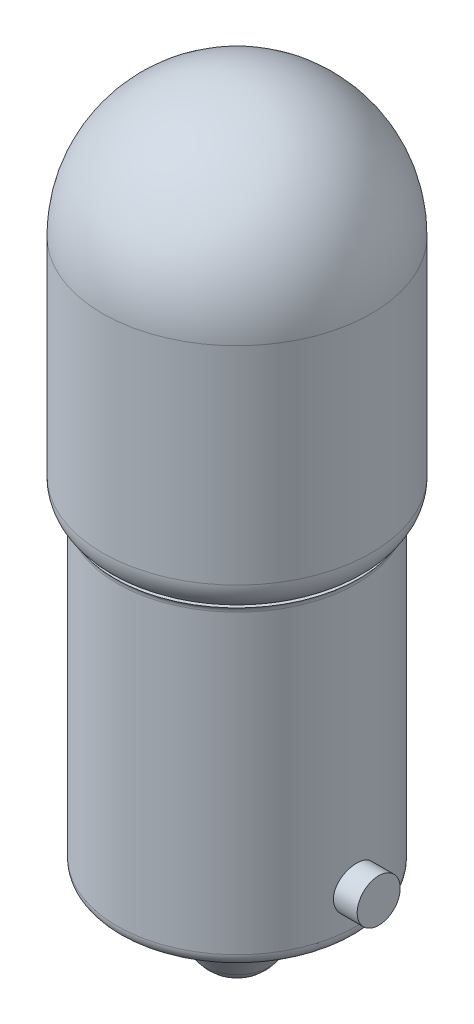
ISO-10303-21;
HEADER;
FILE_DESCRIPTION(('STEP AP214'),'2;1');
FILE_NAME('part.step','',(''),(''),'','','');
FILE_SCHEMA(('AUTOMOTIVE_DESIGN { 1 0 10303 214 1 1 1 1 }'));
ENDSEC;
DATA;
#1=APPLICATION_CONTEXT('core data for automotive mechanical design processes');
#2=APPLICATION_PROTOCOL_DEFINITION('international standard','automotive_design',2000,#1);
#3=PRODUCT_CONTEXT('',#1,'mechanical');
#4=PRODUCT('Part','Part','',(#3));
#5=PRODUCT_RELATED_PRODUCT_CATEGORY('part','',(#4));
#6=PRODUCT_DEFINITION_FORMATION('','',#4);
#7=PRODUCT_DEFINITION_CONTEXT('part definition',#1,'design');
#8=PRODUCT_DEFINITION('design','',#6,#7);
#9=PRODUCT_DEFINITION_SHAPE('','',#8);
#10=(LENGTH_UNIT() NAMED_UNIT(*) SI_UNIT(.MILLI.,.METRE.));
#11=(NAMED_UNIT(*) PLANE_ANGLE_UNIT() SI_UNIT($,.RADIAN.));
#12=(NAMED_UNIT(*) SI_UNIT($,.STERADIAN.) SOLID_ANGLE_UNIT());
#13=UNCERTAINTY_MEASURE_WITH_UNIT(LENGTH_MEASURE(1.E-05),#10,'distance_accuracy_value','');
#14=(GEOMETRIC_REPRESENTATION_CONTEXT(3) GLOBAL_UNCERTAINTY_ASSIGNED_CONTEXT((#13)) GLOBAL_UNIT_ASSIGNED_CONTEXT((#10,
#11,#12)) REPRESENTATION_CONTEXT('',''));
#15=CARTESIAN_POINT('',(0.,0.,0.));
#16=DIRECTION('',(0.,0.,1.));
#17=DIRECTION('',(1.,0.,0.));
#18=AXIS2_PLACEMENT_3D('',#15,#16,#17);
#19=CARTESIAN_POINT('',(0.,12.0875666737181,-4.67973655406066));
#20=DIRECTION('',(0.,-1.,0.));
#21=DIRECTION('',(0.,0.,-1.));
#22=AXIS2_PLACEMENT_3D('',#19,#20,#21);
#23=PLANE('',#22);
#24=CARTESIAN_POINT('',(0.,12.0875666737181,0.));
#25=DIRECTION('',(0.,1.,0.));
#26=DIRECTION('',(0.,0.,1.));
#27=AXIS2_PLACEMENT_3D('',#24,#25,#26);
#28=CIRCLE('',#27,4.67973655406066);
#29=CARTESIAN_POINT('',(0.,12.0875666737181,4.67973655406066));
#30=VERTEX_POINT('',#29);
#31=EDGE_CURVE('E117',#30,#30,#28,.T.);
#32=ORIENTED_EDGE('',*,*,#31,.T.);
#33=EDGE_LOOP('',(#32));
#34=FACE_BOUND('',#33,.T.);
#35=CARTESIAN_POINT('',(0.,12.0875666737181,0.));
#36=DIRECTION('',(0.,-1.,0.));
#37=DIRECTION('',(0.,0.,-1.));
#38=AXIS2_PLACEMENT_3D('',#35,#36,#37);
#39=CIRCLE('',#38,4.52740410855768);
#40=CARTESIAN_POINT('',(0.,12.0875666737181,-4.52740410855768));
#41=VERTEX_POINT('',#40);
#42=EDGE_CURVE('E10',#41,#41,#39,.F.);
#43=ORIENTED_EDGE('',*,*,#42,.F.);
#44=EDGE_LOOP('',(#43));
#45=FACE_BOUND('',#44,.T.);
#46=ADVANCED_FACE('F36',(#34,#45),#23,.F.);
#47=CARTESIAN_POINT('',(0.,0.,0.));
#48=DIRECTION('',(0.,1.,0.));
#49=DIRECTION('',(0.,0.,1.));
#50=AXIS2_PLACEMENT_3D('',#47,#48,#49);
#51=PLANE('',#50);
#52=CARTESIAN_POINT('',(0.,0.,0.));
#53=DIRECTION('',(0.,1.,0.));
#54=DIRECTION('',(0.,0.,1.));
#55=AXIS2_PLACEMENT_3D('',#52,#53,#54);
#56=CIRCLE('',#55,4.0894);
#57=CARTESIAN_POINT('',(0.,0.,4.0894));
#58=VERTEX_POINT('',#57);
#59=EDGE_CURVE('E48',#58,#58,#56,.F.);
#60=ORIENTED_EDGE('',*,*,#59,.T.);
#61=EDGE_LOOP('',(#60));
#62=FACE_BOUND('',#61,.T.);
#63=CARTESIAN_POINT('',(0.,0.,0.));
#64=DIRECTION('',(0.,1.,0.));
#65=DIRECTION('',(0.,0.,1.));
#66=AXIS2_PLACEMENT_3D('',#63,#64,#65);
#67=CIRCLE('',#66,2.9845);
#68=CARTESIAN_POINT('',(0.,0.,2.9845));
#69=VERTEX_POINT('',#68);
#70=EDGE_CURVE('E44',#69,#69,#67,.F.);
#71=ORIENTED_EDGE('',*,*,#70,.F.);
#72=EDGE_LOOP('',(#71));
#73=FACE_BOUND('',#72,.T.);
#74=ADVANCED_FACE('F89',(#62,#73),#51,.F.);
#75=CARTESIAN_POINT('',(0.,11.8872,0.));
#76=DIRECTION('',(0.,-1.,0.));
#77=DIRECTION('',(0.,0.,-1.));
#78=AXIS2_PLACEMENT_3D('',#75,#76,#77);
#79=CYLINDRICAL_SURFACE('',#78,4.5974);
#80=CARTESIAN_POINT('',(-4.52268023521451,1.778,-0.8255));
#81=CARTESIAN_POINT('',(-4.52268110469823,1.82396588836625,-0.825498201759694));
#82=CARTESIAN_POINT('',(-4.52338859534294,1.8699555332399,-0.821647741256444));
#83=CARTESIAN_POINT('',(-4.52613896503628,1.9606405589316,-0.806356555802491));
#84=CARTESIAN_POINT('',(-4.52818301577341,2.0053347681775,-0.794909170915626));
#85=CARTESIAN_POINT('',(-4.53336770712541,2.09210356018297,-0.764784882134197));
#86=CARTESIAN_POINT('',(-4.5365073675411,2.1341804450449,-0.746114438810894));
#87=CARTESIAN_POINT('',(-4.54352835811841,2.21460120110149,-0.702090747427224));
#88=CARTESIAN_POINT('',(-4.54740962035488,2.25294541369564,-0.676738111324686));
#89=CARTESIAN_POINT('',(-4.55552601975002,2.32525388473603,-0.619760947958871));
#90=CARTESIAN_POINT('',(-4.55976437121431,2.35916931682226,-0.58807490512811));
#91=CARTESIAN_POINT('',(-4.56808894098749,2.42123259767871,-0.519463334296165));
#92=CARTESIAN_POINT('',(-4.57217514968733,2.44938008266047,-0.482537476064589));
#93=CARTESIAN_POINT('',(-4.5797693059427,2.49929408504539,-0.404175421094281));
#94=CARTESIAN_POINT('',(-4.58327302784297,2.52101479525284,-0.362709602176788));
#95=CARTESIAN_POINT('',(-4.5892715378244,2.55716383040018,-0.276644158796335));
#96=CARTESIAN_POINT('',(-4.59176640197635,2.57159270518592,-0.232044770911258));
#97=CARTESIAN_POINT('',(-4.59544339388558,2.59259813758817,-0.141483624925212));
#98=CARTESIAN_POINT('',(-4.59663925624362,2.59925690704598,-0.0955415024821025));
#99=CARTESIAN_POINT('',(-4.59763078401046,2.60478906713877,-0.00317762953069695));
#100=CARTESIAN_POINT('',(-4.59742655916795,2.60366306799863,0.0432440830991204));
#101=CARTESIAN_POINT('',(-4.59565171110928,2.5937211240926,0.134686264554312));
#102=CARTESIAN_POINT('',(-4.59409681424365,2.58499368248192,0.179716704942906));
#103=CARTESIAN_POINT('',(-4.58981292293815,2.560236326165,0.267663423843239));
#104=CARTESIAN_POINT('',(-4.58708388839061,2.544206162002,0.310579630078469));
#105=CARTESIAN_POINT('',(-4.58073187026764,2.50521264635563,0.393338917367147));
#106=CARTESIAN_POINT('',(-4.57710428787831,2.48221348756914,0.433164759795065));
#107=CARTESIAN_POINT('',(-4.56935708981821,2.42996116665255,0.508425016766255));
#108=CARTESIAN_POINT('',(-4.5652374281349,2.40070741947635,0.543859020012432));
#109=CARTESIAN_POINT('',(-4.55689470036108,2.33628735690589,0.609853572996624));
#110=CARTESIAN_POINT('',(-4.55267099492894,2.30104363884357,0.640338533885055));
#111=CARTESIAN_POINT('',(-4.54465188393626,2.22590307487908,0.69497546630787));
#112=CARTESIAN_POINT('',(-4.54085648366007,2.18600617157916,0.719127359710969));
#113=CARTESIAN_POINT('',(-4.53412300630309,2.10259651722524,0.760431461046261));
#114=CARTESIAN_POINT('',(-4.53118618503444,2.05907858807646,0.777573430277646));
#115=CARTESIAN_POINT('',(-4.52652217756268,1.96971601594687,0.804281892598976));
#116=CARTESIAN_POINT('',(-4.52479486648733,1.92387161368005,0.813849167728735));
#117=CARTESIAN_POINT('',(-4.52276995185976,1.83183697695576,0.825027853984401));
#118=CARTESIAN_POINT('',(-4.52245289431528,1.78566030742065,0.826747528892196));
#119=CARTESIAN_POINT('',(-4.52323242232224,1.69367939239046,0.82247174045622));
#120=CARTESIAN_POINT('',(-4.52432894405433,1.64787513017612,0.816476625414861));
#121=CARTESIAN_POINT('',(-4.52779401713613,1.55829040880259,0.797034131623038));
#122=CARTESIAN_POINT('',(-4.53015298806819,1.51449736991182,0.783642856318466));
#123=CARTESIAN_POINT('',(-4.5358689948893,1.42977674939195,0.749847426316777));
#124=CARTESIAN_POINT('',(-4.5392260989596,1.38884936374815,0.729442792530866));
#125=CARTESIAN_POINT('',(-4.54660476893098,1.31054294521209,0.681948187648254));
#126=CARTESIAN_POINT('',(-4.55063302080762,1.27320627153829,0.654789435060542));
#127=CARTESIAN_POINT('',(-4.55888100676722,1.20358115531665,0.594650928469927));
#128=CARTESIAN_POINT('',(-4.56310075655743,1.17129312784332,0.561670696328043));
#129=CARTESIAN_POINT('',(-4.57131841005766,1.11228098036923,0.490343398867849));
#130=CARTESIAN_POINT('',(-4.57531298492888,1.08562943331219,0.451935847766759));
#131=CARTESIAN_POINT('',(-4.58257525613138,1.03915744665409,0.371125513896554));
#132=CARTESIAN_POINT('',(-4.58584297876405,1.0193367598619,0.32872287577));
#133=CARTESIAN_POINT('',(-4.59126898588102,0.987199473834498,0.241332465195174));
#134=CARTESIAN_POINT('',(-4.59343266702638,0.974846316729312,0.196358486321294));
#135=CARTESIAN_POINT('',(-4.59642974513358,0.957877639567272,0.104931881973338));
#136=CARTESIAN_POINT('',(-4.59726326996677,0.953261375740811,0.0584793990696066));
#137=CARTESIAN_POINT('',(-4.59750386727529,0.951921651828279,-0.0338878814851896));
#138=CARTESIAN_POINT('',(-4.59693080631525,0.955088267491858,-0.0798010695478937));
#139=CARTESIAN_POINT('',(-4.59446361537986,0.96898484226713,-0.170430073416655));
#140=CARTESIAN_POINT('',(-4.59256949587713,0.979714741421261,-0.215145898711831));
#141=CARTESIAN_POINT('',(-4.5876726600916,1.00838857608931,-0.302059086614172));
#142=CARTESIAN_POINT('',(-4.58467160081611,1.02632173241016,-0.344260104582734));
#143=CARTESIAN_POINT('',(-4.57788682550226,1.0688802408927,-0.425070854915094));
#144=CARTESIAN_POINT('',(-4.57410306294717,1.09350599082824,-0.463680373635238));
#145=CARTESIAN_POINT('',(-4.56610818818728,1.14913352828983,-0.536762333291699));
#146=CARTESIAN_POINT('',(-4.5618920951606,1.18021517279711,-0.571173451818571));
#147=CARTESIAN_POINT('',(-4.55354035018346,1.24770565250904,-0.634329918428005));
#148=CARTESIAN_POINT('',(-4.54940471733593,1.28411573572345,-0.663073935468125));
#149=CARTESIAN_POINT('',(-4.54164448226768,1.36159332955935,-0.714304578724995));
#150=CARTESIAN_POINT('',(-4.53802444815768,1.40269727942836,-0.736736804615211));
#151=CARTESIAN_POINT('',(-4.53175981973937,1.48814061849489,-0.774342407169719));
#152=CARTESIAN_POINT('',(-4.52911428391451,1.53247683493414,-0.789522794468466));
#153=CARTESIAN_POINT('',(-4.52566377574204,1.6104675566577,-0.80902449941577));
#154=CARTESIAN_POINT('',(-4.52455142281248,1.64365896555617,-0.815192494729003));
#155=CARTESIAN_POINT('',(-4.52305934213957,1.71056266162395,-0.823430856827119));
#156=CARTESIAN_POINT('',(-4.52267959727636,1.74427493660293,-0.825501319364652));
#157=CARTESIAN_POINT('',(-4.52268023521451,1.778,-0.8255));
#158=B_SPLINE_CURVE_WITH_KNOTS('',3,(#80,#81,#82,#83,#84,#85,#86,#87,#88,#89,#90,#91,#92,#93,
#94,#95,#96,#97,#98,#99,#100,#101,#102,#103,#104,#105,#106,#107,#108,#109,#110,#111,#112,#113,
#114,#115,#116,#117,#118,#119,#120,#121,#122,#123,#124,#125,#126,#127,#128,#129,#130,#131,#132,
#133,#134,#135,#136,#137,#138,#139,#140,#141,#142,#143,#144,#145,#146,#147,#148,#149,#150,#151,
#152,#153,#154,#155,#156,#157),.UNSPECIFIED.,.T.,.F.,(4,2,2,2,2,2,2,2,2,2,2,2,2,2,2,2,2,2,2,2,2,
2,2,2,2,2,2,2,2,2,2,2,2,2,2,2,2,2,4),(0.,0.137774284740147,0.275669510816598,0.413441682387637,
0.551201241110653,0.690370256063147,0.829548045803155,0.969695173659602,1.10983173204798,
1.24847172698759,1.38710085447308,1.52413718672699,1.66117820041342,1.79893563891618,
1.93670596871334,2.07641483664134,2.21612542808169,2.35603935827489,2.49593884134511,
2.63390234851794,2.77185962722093,2.9087845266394,3.04571878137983,3.18410912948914,
3.3225108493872,3.46259861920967,3.60268131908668,3.74207255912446,3.88145039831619,
4.0188710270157,4.15629056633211,4.29350522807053,4.43072804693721,4.56976182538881,
4.70882822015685,4.84905885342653,4.98915364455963,5.09024067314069,5.19132533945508),.UNSPECIFIED.);
#159=CARTESIAN_POINT('',(-4.52268023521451,1.778,-0.8255));
#160=VERTEX_POINT('',#159);
#161=EDGE_CURVE('E62',#160,#160,#158,.T.);
#162=ORIENTED_EDGE('',*,*,#161,.T.);
#163=EDGE_LOOP('',(#162));
#164=FACE_BOUND('',#163,.T.);
#165=CARTESIAN_POINT('',(4.52268023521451,1.778,-0.8255));
#166=CARTESIAN_POINT('',(4.52268110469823,1.73203411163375,-0.825498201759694));
#167=CARTESIAN_POINT('',(4.52338859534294,1.6860444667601,-0.821647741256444));
#168=CARTESIAN_POINT('',(4.52613896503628,1.5953594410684,-0.806356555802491));
#169=CARTESIAN_POINT('',(4.52818301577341,1.5506652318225,-0.794909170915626));
#170=CARTESIAN_POINT('',(4.53336770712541,1.46389643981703,-0.764784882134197));
#171=CARTESIAN_POINT('',(4.5365073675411,1.4218195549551,-0.746114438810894));
#172=CARTESIAN_POINT('',(4.54352835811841,1.34139879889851,-0.702090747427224));
#173=CARTESIAN_POINT('',(4.54740962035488,1.30305458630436,-0.676738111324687));
#174=CARTESIAN_POINT('',(4.55552601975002,1.23074611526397,-0.619760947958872));
#175=CARTESIAN_POINT('',(4.55976437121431,1.19683068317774,-0.588074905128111));
#176=CARTESIAN_POINT('',(4.56808894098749,1.13476740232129,-0.519463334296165));
#177=CARTESIAN_POINT('',(4.57217514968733,1.10661991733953,-0.482537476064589));
#178=CARTESIAN_POINT('',(4.5797693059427,1.05670591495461,-0.404175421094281));
#179=CARTESIAN_POINT('',(4.58327302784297,1.03498520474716,-0.362709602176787));
#180=CARTESIAN_POINT('',(4.5892715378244,0.998836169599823,-0.276644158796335));
#181=CARTESIAN_POINT('',(4.59176640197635,0.984407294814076,-0.232044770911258));
#182=CARTESIAN_POINT('',(4.59544339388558,0.963401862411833,-0.141483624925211));
#183=CARTESIAN_POINT('',(4.59663925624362,0.956743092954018,-0.0955415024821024));
#184=CARTESIAN_POINT('',(4.59763078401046,0.95121093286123,-0.00317762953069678));
#185=CARTESIAN_POINT('',(4.59742655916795,0.952336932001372,0.0432440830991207));
#186=CARTESIAN_POINT('',(4.59565171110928,0.962278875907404,0.134686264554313));
#187=CARTESIAN_POINT('',(4.59409681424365,0.971006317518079,0.179716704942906));
#188=CARTESIAN_POINT('',(4.58981292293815,0.995763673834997,0.267663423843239));
#189=CARTESIAN_POINT('',(4.58708388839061,1.011793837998,0.310579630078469));
#190=CARTESIAN_POINT('',(4.58073187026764,1.05078735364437,0.393338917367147));
#191=CARTESIAN_POINT('',(4.57710428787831,1.07378651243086,0.433164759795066));
#192=CARTESIAN_POINT('',(4.56935708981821,1.12603883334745,0.508425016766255));
#193=CARTESIAN_POINT('',(4.5652374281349,1.15529258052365,0.543859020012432));
#194=CARTESIAN_POINT('',(4.55689470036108,1.21971264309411,0.609853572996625));
#195=CARTESIAN_POINT('',(4.55267099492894,1.25495636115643,0.640338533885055));
#196=CARTESIAN_POINT('',(4.54465188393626,1.33009692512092,0.694975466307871));
#197=CARTESIAN_POINT('',(4.54085648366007,1.36999382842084,0.719127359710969));
#198=CARTESIAN_POINT('',(4.53412300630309,1.45340348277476,0.760431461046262));
#199=CARTESIAN_POINT('',(4.53118618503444,1.49692141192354,0.777573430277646));
#200=CARTESIAN_POINT('',(4.52652217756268,1.58628398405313,0.804281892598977));
#201=CARTESIAN_POINT('',(4.52479486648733,1.63212838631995,0.813849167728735));
#202=CARTESIAN_POINT('',(4.52276995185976,1.72416302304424,0.825027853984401));
#203=CARTESIAN_POINT('',(4.52245289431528,1.77033969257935,0.826747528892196));
#204=CARTESIAN_POINT('',(4.52323242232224,1.86232060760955,0.82247174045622));
#205=CARTESIAN_POINT('',(4.52432894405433,1.90812486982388,0.816476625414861));
#206=CARTESIAN_POINT('',(4.52779401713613,1.99770959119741,0.797034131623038));
#207=CARTESIAN_POINT('',(4.53015298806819,2.04150263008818,0.783642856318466));
#208=CARTESIAN_POINT('',(4.5358689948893,2.12622325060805,0.749847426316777));
#209=CARTESIAN_POINT('',(4.5392260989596,2.16715063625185,0.729442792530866));
#210=CARTESIAN_POINT('',(4.54660476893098,2.24545705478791,0.681948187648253));
#211=CARTESIAN_POINT('',(4.55063302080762,2.28279372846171,0.654789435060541));
#212=CARTESIAN_POINT('',(4.55888100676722,2.35241884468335,0.594650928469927));
#213=CARTESIAN_POINT('',(4.56310075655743,2.38470687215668,0.561670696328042));
#214=CARTESIAN_POINT('',(4.57131841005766,2.44371901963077,0.490343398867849));
#215=CARTESIAN_POINT('',(4.57531298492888,2.47037056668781,0.451935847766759));
#216=CARTESIAN_POINT('',(4.58257525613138,2.51684255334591,0.371125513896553));
#217=CARTESIAN_POINT('',(4.58584297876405,2.5366632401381,0.328722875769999));
#218=CARTESIAN_POINT('',(4.59126898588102,2.5688005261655,0.241332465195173));
#219=CARTESIAN_POINT('',(4.59343266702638,2.58115368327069,0.196358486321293));
#220=CARTESIAN_POINT('',(4.59642974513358,2.59812236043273,0.104931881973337));
#221=CARTESIAN_POINT('',(4.59726326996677,2.60273862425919,0.0584793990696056));
#222=CARTESIAN_POINT('',(4.59750386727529,2.60407834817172,-0.0338878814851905));
#223=CARTESIAN_POINT('',(4.59693080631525,2.60091173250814,-0.0798010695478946));
#224=CARTESIAN_POINT('',(4.59446361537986,2.58701515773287,-0.170430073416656));
#225=CARTESIAN_POINT('',(4.59256949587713,2.57628525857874,-0.215145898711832));
#226=CARTESIAN_POINT('',(4.5876726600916,2.54761142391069,-0.302059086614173));
#227=CARTESIAN_POINT('',(4.58467160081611,2.52967826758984,-0.344260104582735));
#228=CARTESIAN_POINT('',(4.57788682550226,2.4871197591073,-0.425070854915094));
#229=CARTESIAN_POINT('',(4.57410306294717,2.46249400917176,-0.463680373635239));
#230=CARTESIAN_POINT('',(4.56610818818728,2.40686647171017,-0.5367623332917));
#231=CARTESIAN_POINT('',(4.5618920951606,2.37578482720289,-0.571173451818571));
#232=CARTESIAN_POINT('',(4.55354035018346,2.30829434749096,-0.634329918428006));
#233=CARTESIAN_POINT('',(4.54940471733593,2.27188426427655,-0.663073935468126));
#234=CARTESIAN_POINT('',(4.54164448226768,2.19440667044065,-0.714304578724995));
#235=CARTESIAN_POINT('',(4.53802444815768,2.15330272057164,-0.736736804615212));
#236=CARTESIAN_POINT('',(4.53175981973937,2.06785938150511,-0.774342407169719));
#237=CARTESIAN_POINT('',(4.52911428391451,2.02352316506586,-0.789522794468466));
#238=CARTESIAN_POINT('',(4.52566377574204,1.94553244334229,-0.80902449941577));
#239=CARTESIAN_POINT('',(4.52455142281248,1.91234103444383,-0.815192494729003));
#240=CARTESIAN_POINT('',(4.52305934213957,1.84543733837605,-0.823430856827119));
#241=CARTESIAN_POINT('',(4.52267959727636,1.81172506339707,-0.825501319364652));
#242=CARTESIAN_POINT('',(4.52268023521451,1.778,-0.8255));
#243=B_SPLINE_CURVE_WITH_KNOTS('',3,(#165,#166,#167,#168,#169,#170,#171,#172,#173,#174,#175,
#176,#177,#178,#179,#180,#181,#182,#183,#184,#185,#186,#187,#188,#189,#190,#191,#192,#193,#194,
#195,#196,#197,#198,#199,#200,#201,#202,#203,#204,#205,#206,#207,#208,#209,#210,#211,#212,#213,
#214,#215,#216,#217,#218,#219,#220,#221,#222,#223,#224,#225,#226,#227,#228,#229,#230,#231,#232,
#233,#234,#235,#236,#237,#238,#239,#240,#241,#242),.UNSPECIFIED.,.T.,.F.,(4,2,2,2,2,2,2,2,2,2,2,
2,2,2,2,2,2,2,2,2,2,2,2,2,2,2,2,2,2,2,2,2,2,2,2,2,2,2,4),(0.,0.137774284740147,
0.275669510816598,0.413441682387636,0.551201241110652,0.690370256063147,0.829548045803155,
0.969695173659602,1.10983173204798,1.24847172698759,1.38710085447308,1.52413718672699,
1.66117820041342,1.79893563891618,1.93670596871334,2.07641483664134,2.21612542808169,
2.35603935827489,2.49593884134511,2.63390234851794,2.77185962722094,2.9087845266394,
3.04571878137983,3.18410912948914,3.3225108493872,3.46259861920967,3.60268131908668,
3.74207255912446,3.88145039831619,4.0188710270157,4.15629056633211,4.29350522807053,
4.43072804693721,4.56976182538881,4.70882822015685,4.84905885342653,4.98915364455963,
5.09024067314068,5.19132533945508),.UNSPECIFIED.);
#244=CARTESIAN_POINT('',(4.52268023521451,1.778,-0.8255));
#245=VERTEX_POINT('',#244);
#246=EDGE_CURVE('E57',#245,#245,#243,.T.);
#247=ORIENTED_EDGE('',*,*,#246,.T.);
#248=EDGE_LOOP('',(#247));
#249=FACE_BOUND('',#248,.T.);
#250=CARTESIAN_POINT('',(0.,0.508,0.));
#251=DIRECTION('',(0.,1.,0.));
#252=DIRECTION('',(0.,0.,1.));
#253=AXIS2_PLACEMENT_3D('',#250,#251,#252);
#254=CIRCLE('',#253,4.5974);
#255=CARTESIAN_POINT('',(0.,0.508,4.5974));
#256=VERTEX_POINT('',#255);
#257=EDGE_CURVE('E53',#256,#256,#254,.T.);
#258=ORIENTED_EDGE('',*,*,#257,.T.);
#259=EDGE_LOOP('',(#258));
#260=FACE_BOUND('',#259,.T.);
#261=CARTESIAN_POINT('',(0.,11.8872,0.));
#262=DIRECTION('',(0.,1.,0.));
#263=DIRECTION('',(0.,0.,1.));
#264=AXIS2_PLACEMENT_3D('',#261,#262,#263);
#265=CIRCLE('',#264,4.5974);
#266=CARTESIAN_POINT('',(0.,11.8872,4.5974));
#267=VERTEX_POINT('',#266);
#268=EDGE_CURVE('E115',#267,#267,#265,.T.);
#269=ORIENTED_EDGE('',*,*,#268,.F.);
#270=EDGE_LOOP('',(#269));
#271=FACE_BOUND('',#270,.T.);
#272=ADVANCED_FACE('F66',(#164,#249,#260,#271),#79,.T.);
#273=CARTESIAN_POINT('',(0.,11.8872,0.));
#274=DIRECTION('',(0.,1.,0.));
#275=DIRECTION('',(0.,0.,1.));
#276=AXIS2_PLACEMENT_3D('',#273,#274,#275);
#277=TOROIDAL_SURFACE('',#276,4.88236524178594,0.284965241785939);
#278=ORIENTED_EDGE('',*,*,#31,.F.);
#279=EDGE_LOOP('',(#278));
#280=FACE_BOUND('',#279,.T.);
#281=ORIENTED_EDGE('',*,*,#268,.T.);
#282=EDGE_LOOP('',(#281));
#283=FACE_BOUND('',#282,.T.);
#284=ADVANCED_FACE('F98',(#280,#283),#277,.F.);
#285=CARTESIAN_POINT('',(0.,0.508,0.));
#286=DIRECTION('',(0.,1.,0.));
#287=DIRECTION('',(0.,0.,1.));
#288=AXIS2_PLACEMENT_3D('',#285,#286,#287);
#289=TOROIDAL_SURFACE('',#288,4.0894,0.508);
#290=ORIENTED_EDGE('',*,*,#59,.F.);
#291=EDGE_LOOP('',(#290));
#292=FACE_BOUND('',#291,.T.);
#293=ORIENTED_EDGE('',*,*,#257,.F.);
#294=EDGE_LOOP('',(#293));
#295=FACE_BOUND('',#294,.T.);
#296=ADVANCED_FACE('F38',(#292,#295),#289,.T.);
#297=CARTESIAN_POINT('',(0.,-1.651,0.));
#298=DIRECTION('',(0.,1.,0.));
#299=DIRECTION('',(0.,0.,1.));
#300=AXIS2_PLACEMENT_3D('',#297,#298,#299);
#301=SPHERICAL_SURFACE('',#300,1.524);
#302=CARTESIAN_POINT('',(0.,-2.51439570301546,0.));
#303=DIRECTION('',(0.,1.,0.));
#304=DIRECTION('',(0.,0.,1.));
#305=AXIS2_PLACEMENT_3D('',#302,#303,#304);
#306=CIRCLE('',#305,1.25583592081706);
#307=CARTESIAN_POINT('',(0.,-2.51439570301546,1.25583592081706));
#308=VERTEX_POINT('',#307);
#309=EDGE_CURVE('E122',#308,#308,#306,.T.);
#310=ORIENTED_EDGE('',*,*,#309,.F.);
#311=EDGE_LOOP('',(#310));
#312=FACE_BOUND('',#311,.T.);
#313=ADVANCED_FACE('F83',(#312),#301,.T.);
#314=CARTESIAN_POINT('',(0.,-2.51439570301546,0.));
#315=DIRECTION('',(0.,1.,0.));
#316=DIRECTION('',(0.,0.,1.));
#317=AXIS2_PLACEMENT_3D('',#314,#315,#316);
#318=CONICAL_SURFACE('',#317,1.25583592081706,0.602291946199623);
#319=ORIENTED_EDGE('',*,*,#70,.T.);
#320=EDGE_LOOP('',(#319));
#321=FACE_BOUND('',#320,.T.);
#322=ORIENTED_EDGE('',*,*,#309,.T.);
#323=EDGE_LOOP('',(#322));
#324=FACE_BOUND('',#323,.T.);
#325=ADVANCED_FACE('F78',(#321,#324),#318,.T.);
#326=CARTESIAN_POINT('',(5.4356,1.778,0.));
#327=DIRECTION('',(1.,0.,0.));
#328=DIRECTION('',(0.,0.,-1.));
#329=AXIS2_PLACEMENT_3D('',#326,#327,#328);
#330=PLANE('',#329);
#331=CARTESIAN_POINT('',(5.4356,1.778,0.));
#332=DIRECTION('',(1.,0.,0.));
#333=DIRECTION('',(0.,0.,-1.));
#334=AXIS2_PLACEMENT_3D('',#331,#332,#333);
#335=CIRCLE('',#334,0.8255);
#336=CARTESIAN_POINT('',(5.4356,1.778,-0.8255));
#337=VERTEX_POINT('',#336);
#338=EDGE_CURVE('E127',#337,#337,#335,.T.);
#339=ORIENTED_EDGE('',*,*,#338,.T.);
#340=EDGE_LOOP('',(#339));
#341=FACE_BOUND('',#340,.T.);
#342=ADVANCED_FACE('F82',(#341),#330,.T.);
#343=CARTESIAN_POINT('',(-5.4356,1.778,0.));
#344=DIRECTION('',(1.,0.,0.));
#345=DIRECTION('',(0.,0.,-1.));
#346=AXIS2_PLACEMENT_3D('',#343,#344,#345);
#347=CYLINDRICAL_SURFACE('',#346,0.8255);
#348=ORIENTED_EDGE('',*,*,#338,.F.);
#349=EDGE_LOOP('',(#348));
#350=FACE_BOUND('',#349,.T.);
#351=ORIENTED_EDGE('',*,*,#246,.F.);
#352=EDGE_LOOP('',(#351));
#353=FACE_BOUND('',#352,.T.);
#354=ADVANCED_FACE('F75',(#350,#353),#347,.T.);
#355=CARTESIAN_POINT('',(-5.4356,1.778,0.));
#356=DIRECTION('',(1.,0.,0.));
#357=DIRECTION('',(0.,0.,-1.));
#358=AXIS2_PLACEMENT_3D('',#355,#356,#357);
#359=CIRCLE('',#358,0.8255);
#360=CARTESIAN_POINT('',(-5.4356,1.778,-0.8255));
#361=VERTEX_POINT('',#360);
#362=EDGE_CURVE('E63',#361,#361,#359,.T.);
#363=ORIENTED_EDGE('',*,*,#362,.T.);
#364=EDGE_LOOP('',(#363));
#365=FACE_BOUND('',#364,.T.);
#366=ORIENTED_EDGE('',*,*,#161,.F.);
#367=EDGE_LOOP('',(#366));
#368=FACE_BOUND('',#367,.T.);
#369=ADVANCED_FACE('F69',(#365,#368),#347,.T.);
#370=CARTESIAN_POINT('',(-5.4356,1.778,0.));
#371=DIRECTION('',(1.,0.,0.));
#372=DIRECTION('',(0.,0.,-1.));
#373=AXIS2_PLACEMENT_3D('',#370,#371,#372);
#374=PLANE('',#373);
#375=ORIENTED_EDGE('',*,*,#362,.F.);
#376=EDGE_LOOP('',(#375));
#377=FACE_BOUND('',#376,.T.);
#378=ADVANCED_FACE('F74',(#377),#374,.F.);
#379=CARTESIAN_POINT('',(0.,13.1821106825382,0.));
#380=DIRECTION('',(0.,1.,0.));
#381=DIRECTION('',(0.,0.,1.));
#382=AXIS2_PLACEMENT_3D('',#379,#380,#381);
#383=TOROIDAL_SURFACE('',#382,3.88916654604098,1.26703345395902);
#384=CARTESIAN_POINT('',(0.,13.1821106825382,0.));
#385=DIRECTION('',(0.,1.,0.));
#386=DIRECTION('',(0.,0.,1.));
#387=AXIS2_PLACEMENT_3D('',#384,#385,#386);
#388=CIRCLE('',#387,5.1562);
#389=CARTESIAN_POINT('',(0.,13.1821106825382,5.1562));
#390=VERTEX_POINT('',#389);
#391=EDGE_CURVE('E139',#390,#390,#388,.T.);
#392=ORIENTED_EDGE('',*,*,#391,.F.);
#393=EDGE_LOOP('',(#392));
#394=FACE_BOUND('',#393,.T.);
#395=ORIENTED_EDGE('',*,*,#42,.T.);
#396=EDGE_LOOP('',(#395));
#397=FACE_BOUND('',#396,.T.);
#398=ADVANCED_FACE('F145',(#394,#397),#383,.T.);
#399=CARTESIAN_POINT('',(0.,11.8872,0.));
#400=DIRECTION('',(0.,1.,0.));
#401=DIRECTION('',(0.,0.,1.));
#402=AXIS2_PLACEMENT_3D('',#399,#400,#401);
#403=CYLINDRICAL_SURFACE('',#402,5.1562);
#404=CARTESIAN_POINT('',(0.,21.1328,0.));
#405=DIRECTION('',(0.,1.,0.));
#406=DIRECTION('',(0.,0.,1.));
#407=AXIS2_PLACEMENT_3D('',#404,#405,#406);
#408=CIRCLE('',#407,5.1562);
#409=CARTESIAN_POINT('',(0.,21.1328,5.1562));
#410=VERTEX_POINT('',#409);
#411=EDGE_CURVE('E136',#410,#410,#408,.T.);
#412=ORIENTED_EDGE('',*,*,#411,.F.);
#413=EDGE_LOOP('',(#412));
#414=FACE_BOUND('',#413,.T.);
#415=ORIENTED_EDGE('',*,*,#391,.T.);
#416=EDGE_LOOP('',(#415));
#417=FACE_BOUND('',#416,.T.);
#418=ADVANCED_FACE('F143',(#414,#417),#403,.T.);
#419=CARTESIAN_POINT('',(0.,21.1328,0.));
#420=DIRECTION('',(0.,1.,0.));
#421=DIRECTION('',(0.,0.,-1.));
#422=AXIS2_PLACEMENT_3D('',#419,#420,#421);
#423=SPHERICAL_SURFACE('',#422,5.1562);
#424=ORIENTED_EDGE('',*,*,#411,.T.);
#425=EDGE_LOOP('',(#424));
#426=FACE_BOUND('',#425,.T.);
#427=ADVANCED_FACE('F152',(#426),#423,.T.);
#428=CLOSED_SHELL('',(#46,#74,#272,#284,#296,#313,#325,#342,#354,#369,#378,#398,#418,#427));
#429=CARTESIAN_POINT('',(0.,6.4516,0.));
#430=DIRECTION('',(0.,1.,0.));
#431=DIRECTION('',(0.,0.,1.));
#432=AXIS2_PLACEMENT_3D('',#429,#430,#431);
#433=PLANE('',#432);
#434=CARTESIAN_POINT('',(0.,6.4516,0.));
#435=DIRECTION('',(0.,1.,0.));
#436=DIRECTION('',(0.,0.,1.));
#437=AXIS2_PLACEMENT_3D('',#434,#435,#436);
#438=CIRCLE('',#437,4.48853898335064);
#439=CARTESIAN_POINT('',(0.,6.4516,4.48853898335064));
#440=VERTEX_POINT('',#439);
#441=EDGE_CURVE('E130',#440,#440,#438,.T.);
#442=ORIENTED_EDGE('',*,*,#441,.T.);
#443=EDGE_LOOP('',(#442));
#444=FACE_BOUND('',#443,.T.);
#445=ADVANCED_FACE('F95',(#444),#433,.T.);
#446=CARTESIAN_POINT('',(0.,11.8872,0.));
#447=DIRECTION('',(0.,1.,0.));
#448=DIRECTION('',(0.,0.,1.));
#449=AXIS2_PLACEMENT_3D('',#446,#447,#448);
#450=CYLINDRICAL_SURFACE('',#449,4.48853898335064);
#451=CARTESIAN_POINT('',(0.,12.0875666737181,0.));
#452=DIRECTION('',(0.,1.,0.));
#453=DIRECTION('',(0.,0.,1.));
#454=AXIS2_PLACEMENT_3D('',#451,#452,#453);
#455=CIRCLE('',#454,4.48853898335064);
#456=CARTESIAN_POINT('',(0.,12.0875666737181,4.48853898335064));
#457=VERTEX_POINT('',#456);
#458=EDGE_CURVE('E133',#457,#457,#455,.F.);
#459=ORIENTED_EDGE('',*,*,#458,.F.);
#460=EDGE_LOOP('',(#459));
#461=FACE_BOUND('',#460,.T.);
#462=ORIENTED_EDGE('',*,*,#441,.F.);
#463=EDGE_LOOP('',(#462));
#464=FACE_BOUND('',#463,.T.);
#465=ADVANCED_FACE('F91',(#461,#464),#450,.F.);
#466=CARTESIAN_POINT('',(0.,12.0875666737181,-4.52740410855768));
#467=DIRECTION('',(0.,1.,0.));
#468=DIRECTION('',(0.,0.,1.));
#469=AXIS2_PLACEMENT_3D('',#466,#467,#468);
#470=PLANE('',#469);
#471=ORIENTED_EDGE('',*,*,#458,.T.);
#472=EDGE_LOOP('',(#471));
#473=FACE_BOUND('',#472,.T.);
#474=ADVANCED_FACE('F94',(#473),#470,.F.);
#475=CLOSED_SHELL('',(#445,#465,#474));
#476=ORIENTED_CLOSED_SHELL('',*,#475,.T.);
#477=BREP_WITH_VOIDS('B2',#428,(#476));
#478=ADVANCED_BREP_SHAPE_REPRESENTATION('',(#18,#477),#14);
#479=SHAPE_DEFINITION_REPRESENTATION(#9,#478);
ENDSEC;
END-ISO-10303-21;
